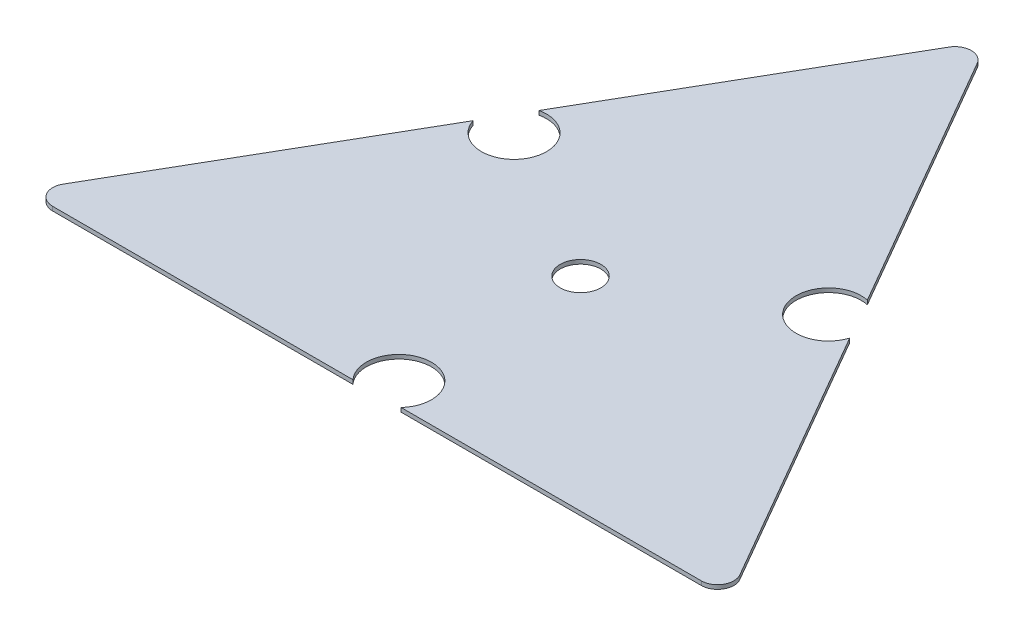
from build123d import *

# Parameters (mm, degrees)
ESQUISSE1_R      = 2.5
EXTRUSION1_DEPTH = 0.5
CONG_1_R         = 2


with BuildPart() as part:
    # Esquisse1 → Extrusion1 (new body)
    with BuildSketch(Plane(origin=(0, 0, 0), x_dir=(1, 0, 0), z_dir=(0, 1, 0))):
        with BuildLine():
            Line((0, 50), (-20.168946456, 15.066360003))
            ThreePointArc((-20.168946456, 15.066360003), (-15.859776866, 9.156646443), (-23.132323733, 9.933639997))
            Line((-23.132323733, 9.933639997), (-43.301270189, -25))
            Line((-43.301270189, -25), (-2.963377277, -25))
            ThreePointArc((-2.963377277, -25), (0, -18.313292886), (2.963377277, -25))
            Line((2.963377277, -25), (43.301270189, -25))
            Line((43.301270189, -25), (23.132323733, 9.933639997))
            ThreePointArc((23.132323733, 9.933639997), (15.859776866, 9.156646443), (20.168946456, 15.066360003))
            Line((20.168946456, 15.066360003), (0, 50))
        make_face()
        with Locations(Location((0, 0, 0), (0, 0, 270))):
            Circle(ESQUISSE1_R, mode=Mode.SUBTRACT)
    extrude(amount=-EXTRUSION1_DEPTH)

    # Cong_1
    cong_1_edges = [part.edges().sort_by_distance(p)[0] for p in [
        (-43.301270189, -0.25, 25),
        (0, -0.25, -50),
        (43.301270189, -0.25, 25),
    ]]
    fillet(cong_1_edges, radius=CONG_1_R)


solid = part.part
